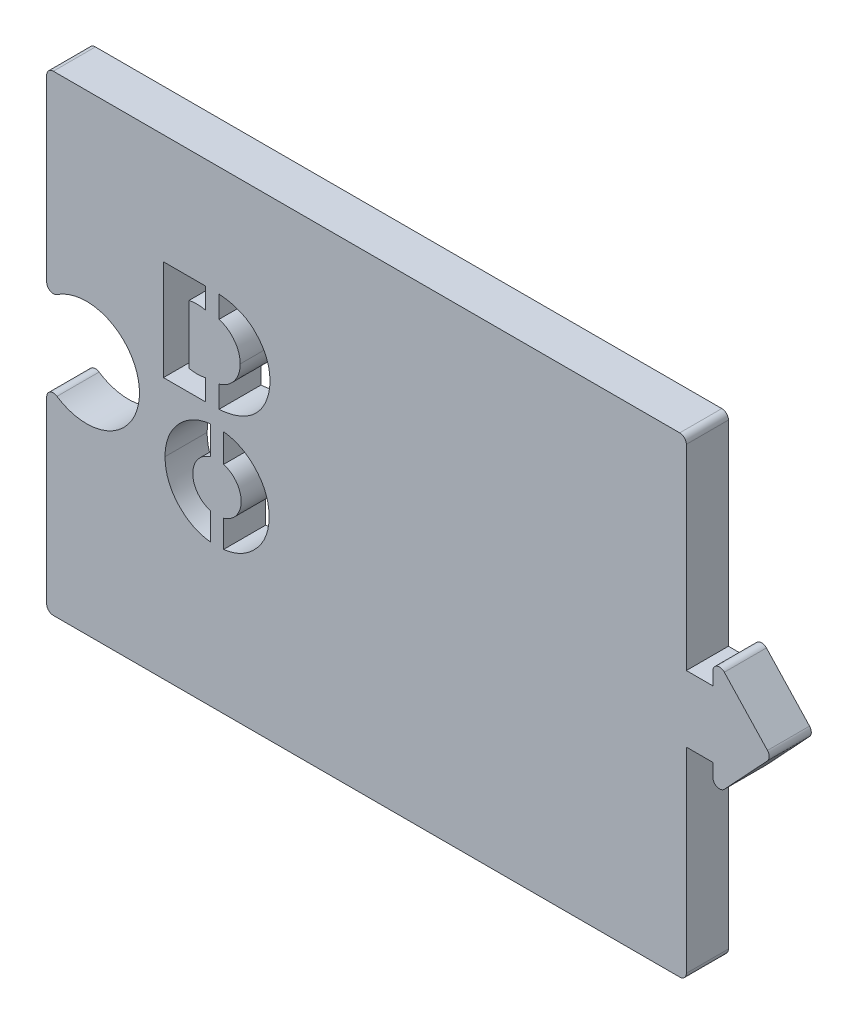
from build123d import *

# Parameters (mm, degrees)
BOSS_EXTRUDE1_DEPTH = 3.175
CUT_EXTRUDE7_DEPTH  = 66.317398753
BOSS_EXTRUDE2_DEPTH = 3.175
FILLET1_R           = 0.5


with BuildPart() as part:
    # Sketch1 → Boss-Extrude1 (new body)
    with BuildSketch(Plane.XY):
        with BuildLine():
            Line((48.26, 35.56), (48.26, 20.28))
            Line((48.26, 20.28), (50.26, 20.28))
            Line((50.26, 20.28), (50.26, 22.53))
            Line((50.26, 22.53), (54.697059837, 17.78))
            Line((54.697059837, 17.78), (50.26, 13.03))
            Line((50.26, 13.03), (50.26, 15.28))
            Line((50.26, 15.28), (48.26, 15.28))
            Line((48.26, 15.28), (48.26, 0))
            Line((48.26, 0), (0, 0))
            Line((0, 0), (0, 15.134248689))
            ThreePointArc((0, 15.134248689), (7, 17.78), (0, 20.425751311))
            Line((0, 20.425751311), (0, 35.56))
            Line((0, 35.56), (48.26, 35.56))
        make_face()
    extrude(amount=BOSS_EXTRUDE1_DEPTH)

    # Sketch8 → Cut-Extrude7 (cut, through all)
    # profile 1 of 2: a face of its own
    with BuildSketch(Plane.XY.offset(3.175)):
        with BuildLine():
            Line((8.809753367, 27.263856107), (12.546221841, 27.263856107))
            add(Edge.make_bspline(
                [(12.546221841, 27.263856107), (12.631412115, 27.26302955), (12.799462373, 27.261399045), (13.04739161, 27.248066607), (13.287962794, 27.225989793), (13.521067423, 27.196343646), (13.746265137, 27.154366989), (13.964294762, 27.10693427), (14.174717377, 27.049680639), (14.37839815, 26.984654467), (14.573537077, 26.907657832), (14.762842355, 26.825864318), (14.942293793, 26.730551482), (15.116855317, 26.63130031), (15.281890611, 26.519349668), (15.439381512, 26.399439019), (15.591070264, 26.272413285), (15.779154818, 26.090343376), (15.995083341, 25.85162364), (16.223309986, 25.549732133), (16.415957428, 25.23441034), (16.572583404, 24.90532524), (16.696954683, 24.563939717), (16.781788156, 24.208163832), (16.836649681, 23.840588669), (16.84305935, 23.590857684), (16.846299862, 23.464602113)],
                knots=[0, 0, 0, 0, 0.951772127, 1.877509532, 2.773047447, 3.650573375, 4.501739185, 5.331620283, 6.142888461, 6.937380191, 7.719001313, 8.485918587, 9.239906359, 9.987928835, 10.728462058, 11.465853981, 12.199023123, 12.937456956, 14.388927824, 15.790819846, 17.159896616, 18.509821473, 19.856676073, 21.211193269, 22.590073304, 24, 24, 24, 24], degree=3))
            add(Edge.make_bspline(
                [(16.846299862, 23.464602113), (16.844992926, 23.383753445), (16.842381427, 23.222202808), (16.818303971, 22.981682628), (16.778836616, 22.743640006), (16.722878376, 22.508763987), (16.653073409, 22.275863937), (16.566248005, 22.045818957), (16.464042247, 21.818757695), (16.347927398, 21.595102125), (16.214980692, 21.379606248), (16.068148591, 21.17298999), (15.903943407, 20.98011288), (15.724350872, 20.799540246), (15.530551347, 20.630184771), (15.320473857, 20.473314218), (15.095140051, 20.329160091), (14.855804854, 20.195760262), (14.601971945, 20.077862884), (14.334873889, 19.97582339), (14.055884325, 19.887305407), (13.762712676, 19.818483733), (13.457269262, 19.762290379), (13.138797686, 19.72423774), (12.808034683, 19.69768993), (12.58326711, 19.695609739), (12.468835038, 19.694550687)],
                knots=[0, 0, 0, 0, 0.896736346, 1.791845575, 2.678642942, 3.571861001, 4.468662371, 5.374279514, 6.2975283, 7.229780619, 8.16789406, 9.104405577, 10.039140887, 10.974577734, 11.927492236, 12.891857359, 13.880393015, 14.893112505, 15.929451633, 16.982355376, 18.063363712, 19.173945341, 20.320958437, 21.507060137, 22.730812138, 24, 24, 24, 24], degree=3))
            Line((12.468835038, 19.694550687), (8.809753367, 19.694550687))
            Line((8.809753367, 19.694550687), (8.809753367, 27.263856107))
        make_face()
    # profile 2 of 2: a face of its own
    with BuildSketch(Plane.XY.offset(3.175)):
        with BuildLine():
            add(Edge.make_bspline(
                [(12.806804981, 10.705986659), (12.674250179, 10.709283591), (12.412939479, 10.715782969), (12.028333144, 10.769401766), (11.659806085, 10.858640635), (11.306006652, 10.981511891), (10.968851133, 11.142114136), (10.646306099, 11.336976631), (10.339912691, 11.567740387), (10.053040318, 11.830821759), (9.790677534, 12.118059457), (9.561481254, 12.425584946), (9.365334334, 12.74740101), (9.20808592, 13.087017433), (9.082039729, 13.440448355), (8.9955017, 13.810747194), (8.941280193, 14.196028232), (8.934873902, 14.458333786), (8.931624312, 14.591388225)],
                knots=[0, 0, 0, 0, 1.040485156, 2.051150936, 3.042006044, 4.013743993, 4.986420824, 5.968868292, 6.967833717, 7.993026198, 9.021042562, 10.017717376, 11.000164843, 11.974671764, 12.951282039, 13.941245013, 14.955696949, 16, 16, 16, 16], degree=3))
            add(Edge.make_bspline(
                [(8.931624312, 14.591388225), (8.934933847, 14.723939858), (8.941458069, 14.985244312), (8.994830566, 15.369426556), (9.084553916, 15.737339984), (9.207068, 16.090767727), (9.36767152, 16.427146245), (9.560932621, 16.749454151), (9.792425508, 17.054031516), (10.054907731, 17.340311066), (10.340850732, 17.603589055), (10.648338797, 17.832309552), (10.969803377, 18.02810745), (11.308224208, 18.185764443), (11.660230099, 18.311757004), (12.029068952, 18.398316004), (12.4128995, 18.452532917), (12.674236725, 18.458938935), (12.806804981, 18.462188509)],
                knots=[0, 0, 0, 0, 1.042650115, 2.055418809, 3.044613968, 4.018373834, 4.993074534, 5.972308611, 6.970293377, 7.997618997, 9.024944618, 10.023693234, 11.008184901, 11.981251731, 12.956283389, 13.944581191, 14.957349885, 16, 16, 16, 16], degree=3))
            add(Edge.make_bspline(
                [(12.806804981, 18.462188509), (12.945218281, 18.459087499), (13.217298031, 18.452991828), (13.616201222, 18.397048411), (13.99772618, 18.308510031), (14.362525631, 18.183910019), (14.709685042, 18.022397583), (15.040378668, 17.825850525), (15.352273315, 17.592011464), (15.643426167, 17.326294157), (15.90834515, 17.036630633), (16.143009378, 16.730173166), (16.340091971, 16.408451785), (16.503068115, 16.072966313), (16.626832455, 15.722432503), (16.715936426, 15.35810756), (16.771977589, 14.979574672), (16.778145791, 14.722022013), (16.781274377, 14.591388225)],
                knots=[0, 0, 0, 0, 1.074758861, 2.112659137, 3.122409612, 4.113641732, 5.101551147, 6.09171544, 7.096704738, 8.124480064, 9.149462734, 10.142373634, 11.118315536, 12.07546588, 13.034570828, 14.000204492, 14.985679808, 16, 16, 16, 16], degree=3))
            add(Edge.make_bspline(
                [(16.781274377, 14.591388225), (16.778151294, 14.460266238), (16.771993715, 14.201741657), (16.715868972, 13.821788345), (16.627189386, 13.456336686), (16.502357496, 13.104790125), (16.340587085, 12.767315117), (16.14296751, 12.443908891), (15.908418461, 12.135919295), (15.643397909, 11.844907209), (15.352733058, 11.577601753), (15.040342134, 11.343815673), (14.710020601, 11.147551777), (14.362989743, 10.985434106), (13.998406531, 10.85956449), (13.61617994, 10.771193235), (13.217303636, 10.715165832), (12.94522017, 10.709081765), (12.806804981, 10.705986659)],
                knots=[0, 0, 0, 0, 1.016130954, 2.003438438, 2.970871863, 3.928124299, 4.890229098, 5.867504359, 6.861503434, 7.887293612, 8.915628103, 9.918676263, 10.906928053, 11.889507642, 12.883621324, 13.891421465, 14.927317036, 16, 16, 16, 16], degree=3))
        make_face()
        with BuildLine():
            add(Edge.make_bspline(
                [(12.806804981, 15.471845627), (12.774877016, 15.470025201), (12.710820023, 15.466372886), (12.618389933, 15.431541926), (12.530647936, 15.377713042), (12.449561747, 15.303612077), (12.379654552, 15.20932036), (12.33021679, 15.094542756), (12.301086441, 14.961749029), (12.297601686, 14.867511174), (12.295760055, 14.817708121)],
                knots=[0, 0, 0, 0, 0.826159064, 1.657520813, 2.530942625, 3.488112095, 4.491546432, 5.555239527, 6.707986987, 8, 8, 8, 8], degree=3))
            add(Edge.make_bspline(
                [(12.295760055, 14.817708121), (12.297655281, 14.767918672), (12.301259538, 14.673231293), (12.329927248, 14.539808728), (12.379759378, 14.424735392), (12.449063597, 14.33027802), (12.531156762, 14.257784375), (12.618333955, 14.203812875), (12.710833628, 14.16905829), (12.774881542, 14.165396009), (12.806804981, 14.163570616)],
                knots=[0, 0, 0, 0, 1.291388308, 2.455905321, 3.519084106, 4.522033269, 5.47028112, 6.343280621, 7.174240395, 8, 8, 8, 8], degree=3))
            add(Edge.make_bspline(
                [(12.806804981, 14.163570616), (12.849400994, 14.165698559), (12.93271858, 14.169860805), (13.050850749, 14.20574454), (13.156780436, 14.264678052), (13.247881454, 14.345445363), (13.32499666, 14.443129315), (13.378509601, 14.557155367), (13.412460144, 14.683381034), (13.415537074, 14.771724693), (13.417138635, 14.817708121)],
                knots=[0, 0, 0, 0, 1.018881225, 1.992926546, 2.927422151, 3.902723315, 4.891802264, 5.88807411, 6.90072932, 8, 8, 8, 8], degree=3))
            add(Edge.make_bspline(
                [(13.417138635, 14.817708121), (13.415424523, 14.863179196), (13.412096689, 14.95145823), (13.379137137, 15.077514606), (13.324601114, 15.191184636), (13.247419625, 15.288403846), (13.157093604, 15.371372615), (13.049980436, 15.428881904), (12.932356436, 15.46584563), (12.849436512, 15.469808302), (12.806804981, 15.471845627)],
                knots=[0, 0, 0, 0, 1.088197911, 2.112663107, 3.098941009, 4.088526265, 5.072039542, 6.017223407, 6.980597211, 8, 8, 8, 8], degree=3))
        make_face(mode=Mode.SUBTRACT)
    extrude(amount=-CUT_EXTRUDE7_DEPTH, mode=Mode.SUBTRACT)

    # Sketch9 → Boss-Extrude2 (add)
    with BuildSketch(Plane.XY.offset(3.175)):
        with BuildLine():
            Line((10.737754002, 25.700181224), (10.737754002, 21.26001006))
            add(Edge.make_bspline(
                [(10.737754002, 21.26001006), (11.368504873, 21.129019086), (11.993648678, 21.272245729)],
                knots=[0, 0, 0, 1, 1, 1], degree=2))
            Line((11.993648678, 21.272245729), (11.993648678, 19.385515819))
            Line((11.993648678, 19.385515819), (12.993648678, 19.385515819))
            Line((12.993648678, 19.385515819), (12.993648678, 21.370131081))
            add(Edge.make_bspline(
                [(12.993648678, 21.370131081), (13.931192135, 21.607945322), (14.619451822, 22.535019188), (14.597675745, 23.480095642)],
                knots=[0, 0, 0, 0, 1, 1, 1, 1], degree=3))
            add(Edge.make_bspline(
                [(12.993648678, 25.590060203), (13.931192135, 25.352245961), (14.619451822, 24.425172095), (14.597675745, 23.480095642)],
                knots=[0, 0, 0, 0, 1, 1, 1, 1], degree=3))
            Line((12.993648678, 25.590060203), (12.993648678, 28.636127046))
            Line((12.993648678, 28.636127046), (11.993648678, 28.636127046))
            Line((11.993648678, 28.636127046), (11.993648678, 25.687945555))
            add(Edge.make_bspline(
                [(10.737754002, 25.700181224), (11.368504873, 25.831172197), (11.993648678, 25.687945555)],
                knots=[0, 0, 0, 1, 1, 1], degree=2))
        make_face()
        with BuildLine():
            Line((12.347166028, 18.832632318), (13.347166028, 18.832632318))
            Line((13.347166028, 18.832632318), (13.347166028, 16.291807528))
            ThreePointArc((13.347166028, 16.291807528), (14.672785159, 14.535943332), (13.347166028, 12.780079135))
            Line((13.347166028, 12.780079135), (13.347166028, 10.32398662))
            Line((13.347166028, 10.32398662), (12.347166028, 10.32398662))
            Line((12.347166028, 10.32398662), (12.347166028, 12.780041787))
            ThreePointArc((12.347166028, 12.780041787), (11.021415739, 14.535943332), (12.347166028, 16.291844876))
            Line((12.347166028, 16.291844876), (12.347166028, 18.832632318))
        make_face()
    extrude(amount=-BOSS_EXTRUDE2_DEPTH)

    # Fillet1
    fillet1_edges = [part.edges().sort_by_distance(p)[0] for p in [
        (0, 15.134248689, 1.5875),
        (0, 0, 1.5875),
        (48.26, 0, 1.5875),
        (50.26, 13.03, 1.5875),
        (54.697059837, 17.78, 1.5875),
        (50.26, 22.53, 1.5875),
        (48.26, 35.56, 1.5875),
        (0, 35.56, 1.5875),
        (0, 20.425751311, 1.5875),
    ]]
    fillet(fillet1_edges, radius=FILLET1_R)


solid = part.part
